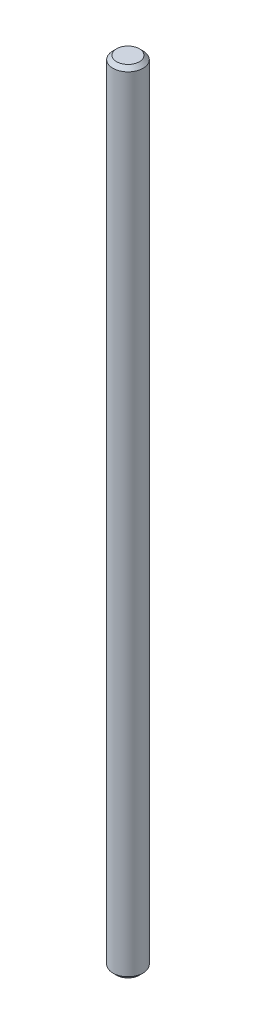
from build123d import *

# Parameters (mm, degrees)
ESQUISSE1_R      = 2
EXTRUSION1_DEPTH = 105
CHANFREIN1_SIZE  = 0.5


with BuildPart() as part:
    # Esquisse1 → Extrusion1 (new body)
    with BuildSketch(Plane(origin=(0, 0, 0), x_dir=(1, 0, 0), z_dir=(0, 1, 0))):
        with Locations(Location((0, 0, 0), (0, 0, 270))):
            Circle(ESQUISSE1_R)
    extrude(amount=EXTRUSION1_DEPTH)

    # Chanfrein1
    chanfrein1_edges = [part.edges().sort_by_distance(p)[0] for p in [
        (0, 0, -2),
        (0, 105, -2),
    ]]
    chamfer(chanfrein1_edges, length=CHANFREIN1_SIZE)


solid = part.part
